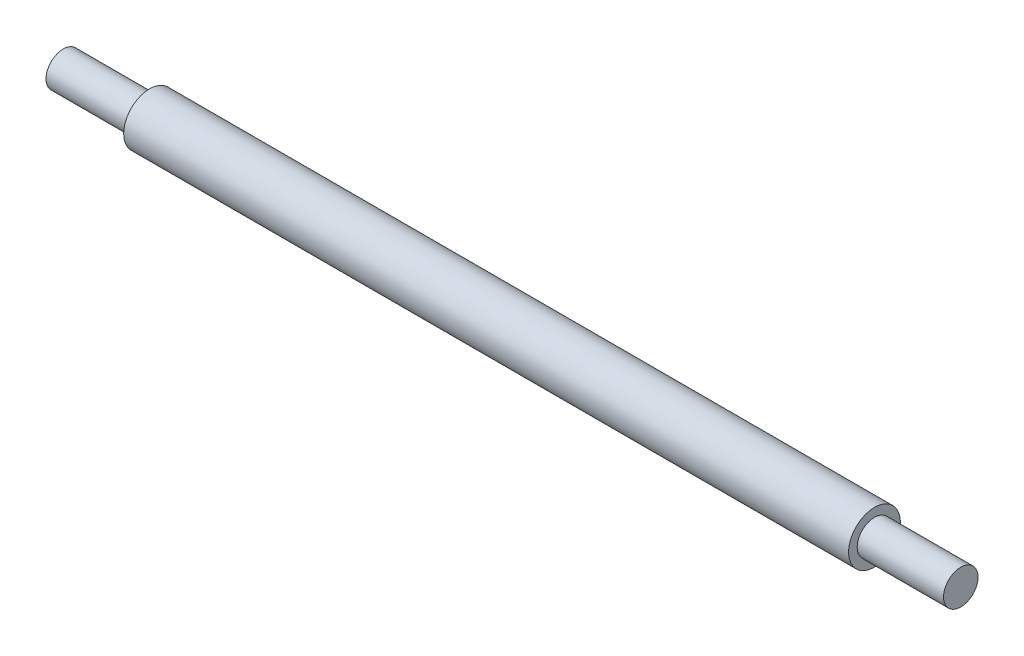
from build123d import *


with BuildPart() as part:
    # Sketch1 → Revolve1 (revolve)
    with BuildSketch(Plane.XY, mode=Mode.PRIVATE) as revolve1_sk:
        Polygon((0, 0), (0, 2), (10, 2), (10, 3), (94, 3), (94, 2), (104, 2), (104, 0), align=None)
    revolve(revolve1_sk.sketch.rotate(Axis((-34.006921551, 0, 0), (1, 0, 0)), 90), axis=Axis((-34.006921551, 0, 0), (1, 0, 0)))


solid = part.part
